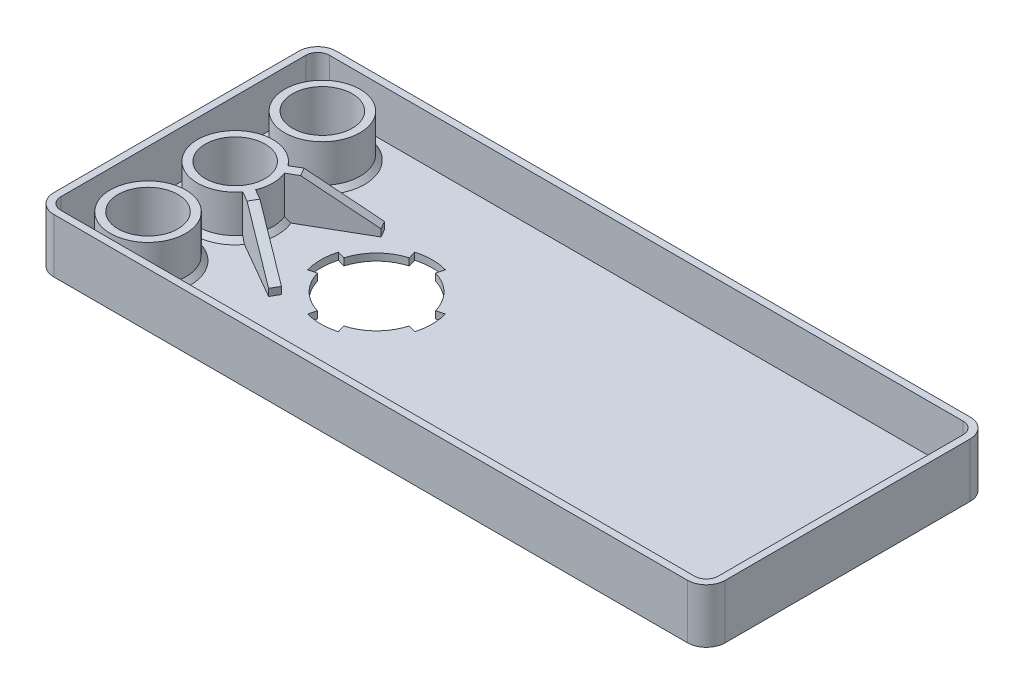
from build123d import *

# Parameters (mm, degrees)
BOSS_EXTRU_1_DEPTH           = 23
COQUE1_T                     = -3
ESQUISSE4_R                  = 16
BOSS_EXTRU_3_DEPTH           = 18
ESQUISSE5_R                  = 12.7
ESQUISSE5_R_2                = 20.25
ENL_V_MAT_EXTRU_2_DEPTH      = 157.036053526
CHANFREIN1_SIZE              = 2
ENL_V_MAT_EXTRU_3_DEPTH      = 156.904618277
R_P_TITION_CIRCULAIRE1_COUNT = 4
BOSS_EXTRU_5_REACH           = 157.905
CHANFREIN4_SIZE              = 25
CHANFREIN4_SIZE2             = 15


with BuildPart() as part:
    # Esquisse1 → Boss.-Extru.1 (new body)
    with BuildSketch(Plane(origin=(0, 0, 0), x_dir=(1, 0, 0), z_dir=(0, 1, 0))):
        with BuildLine():
            Line((-134.5, 60), (134.5, 60))
            ThreePointArc((134.5, 60), (140.156854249, 57.656854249), (142.5, 52))
            Line((142.5, 52), (142.5, -52))
            ThreePointArc((142.5, -52), (140.156854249, -57.656854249), (134.5, -60))
            Line((134.5, -60), (-134.5, -60))
            ThreePointArc((-134.5, -60), (-140.156854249, -57.656854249), (-142.5, -52))
            Line((-142.5, -52), (-142.5, 52))
            ThreePointArc((-142.5, 52), (-140.156854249, 57.656854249), (-134.5, 60))
        make_face()
    extrude(amount=BOSS_EXTRU_1_DEPTH)

    # Coque1
    coque1_openings = [part.faces().sort_by_distance(p)[0] for p in [
        (0, 23, 0),
    ]]
    offset(amount=COQUE1_T, openings=coque1_openings, kind=Kind.INTERSECTION)

    # Esquisse4 → Boss.-Extru.3 (add)
    with BuildSketch(Plane(origin=(0, 3, -3), x_dir=(1, 0, 0), z_dir=(0, -1, 0))):
        with Locations(Location((-117.5, 3, 0), (0, 0, 270))):
            Circle(ESQUISSE4_R)
        with Locations(Location((-117.5, 40, 0), (0, 0, 270))):
            Circle(ESQUISSE4_R)
        with Locations(Location((-117.5, -34, 0), (0, 0, 270))):
            Circle(ESQUISSE4_R)
    extrude(amount=-BOSS_EXTRU_3_DEPTH)

    # Esquisse5 → Enl_v. mat.-Extru.2 (cut, through all)
    with BuildSketch(Plane(origin=(0, 21, 0), x_dir=(1, 0, 0), z_dir=(0, 1, 0))):
        with Locations(Location((-117.5, 37, 0), (0, 0, 270))):
            Circle(ESQUISSE5_R)
        with Locations(Location((-117.5, 0, 0), (0, 0, 270))):
            Circle(ESQUISSE5_R)
        with Locations(Location((-117.5, -37, 0), (0, 0, 270))):
            Circle(ESQUISSE5_R)
        with Locations(Location((-57.5, 0, 0), (0, 0, 270))):
            Circle(ESQUISSE5_R_2)
    extrude(amount=-ENL_V_MAT_EXTRU_2_DEPTH, mode=Mode.SUBTRACT)

    # Chanfrein1
    chanfrein1_edges = [part.edges().sort_by_distance(p)[0] for p in [
        (-117.5, 3, 16),
        (-117.5, 3, 53),
        (-117.5, 3, -21),
    ]]
    chamfer(chanfrein1_edges, length=CHANFREIN1_SIZE)

    # Esquisse7 → Enl_v. mat.-Extru.3 (cut, through all)
    with BuildSketch(Plane(origin=(0, 3, 0), x_dir=(1, 0, 0), z_dir=(0, 1, 0))):
        with BuildLine():
            Line((-80.233839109, 6.518823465), (-57.5, 0))
            Line((-57.5, 0), (-80.233839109, -6.518823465))
            ThreePointArc((-80.233839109, -6.518823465), (-81.15, 0), (-80.233839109, 6.518823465))
        make_face()
    enl_v_mat_extru_3 = extrude(amount=-ENL_V_MAT_EXTRU_3_DEPTH, mode=Mode.SUBTRACT)

    # R_p_tition circulaire1: Enl_v. mat.-Extru.3 ×4 about axis
    r_p_tition_circulaire1_axis = Axis((-57.5, 0, 0), (0, 1, 0))
    for i in range(1, R_P_TITION_CIRCULAIRE1_COUNT):
        add(enl_v_mat_extru_3.rotate(r_p_tition_circulaire1_axis, i * 360 / R_P_TITION_CIRCULAIRE1_COUNT), mode=Mode.SUBTRACT)

    # Boss.-Extru.5: up to this face of the body (flat: up to its plane)
    boss_extru_5_end = Plane(part.part.faces().sort_by_distance((-117.5, 21, 15.54745166))[0])
    # Esquisse8 → Boss.-Extru.5 (add, up to the picked face)
    with BuildSketch(Plane(origin=(0, 3, 0), x_dir=(1, 0, 0), z_dir=(0, 1, 0)), mode=Mode.PRIVATE) as boss_extru_5_sk1:
        with BuildLine():
            Line((-104.699484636, -9.59931281), (-78.718722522, -24.59931281))
            Line((-78.718722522, -24.59931281), (-76.718722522, -21.135211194))
            Line((-76.718722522, -21.135211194), (-102.718471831, -6.124248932))
            ThreePointArc((-102.718471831, -6.124248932), (-103.599953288, -7.923932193), (-104.699484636, -9.59931281))
        make_face()
    boss_extru_5_tool1 = split(extrude(boss_extru_5_sk1.sketch, amount=BOSS_EXTRU_5_REACH, mode=Mode.PRIVATE), bisect_by=boss_extru_5_end, keep=Keep.BOTH, mode=Mode.PRIVATE)
    # Esquisse8 → Boss.-Extru.5 (add, up to the picked face)
    with BuildSketch(Plane(origin=(0, 3, 0), x_dir=(1, 0, 0), z_dir=(0, 1, 0)), mode=Mode.PRIVATE) as boss_extru_5_sk2:
        with BuildLine():
            Line((-78.718722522, 24.59931281), (-76.718722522, 21.135211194))
            Line((-76.718722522, 21.135211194), (-102.718471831, 6.124248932))
            ThreePointArc((-102.718471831, 6.124248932), (-103.599953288, 7.923932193), (-104.699484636, 9.59931281))
            Line((-104.699484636, 9.59931281), (-78.718722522, 24.59931281))
        make_face()
    boss_extru_5_tool2 = split(extrude(boss_extru_5_sk2.sketch, amount=BOSS_EXTRU_5_REACH, mode=Mode.PRIVATE), bisect_by=boss_extru_5_end, keep=Keep.BOTH, mode=Mode.PRIVATE)
    add(boss_extru_5_tool1.solids().sort_by(Axis((-90.677493, 3, 15.385231), (0, 1, 0)))[0])
    add(boss_extru_5_tool2.solids().sort_by(Axis((-90.677493, 3, -15.385231), (0, 1, 0)))[0])

    # Chanfrein4
    chanfrein4_edges = [part.edges().sort_by_distance(p)[0] for p in [
        (-77.718722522, 21, 22.867262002),
        (-77.718722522, 21, -22.867262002),
    ]]
    chanfrein4_side = [part.faces().sort_by_distance(p)[0] for p in [
        (-91.333450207, 21, -16.448662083),
    ]]
    chamfer(chanfrein4_edges, length=CHANFREIN4_SIZE, length2=CHANFREIN4_SIZE2, reference=chanfrein4_side[0])


solid = part.part
